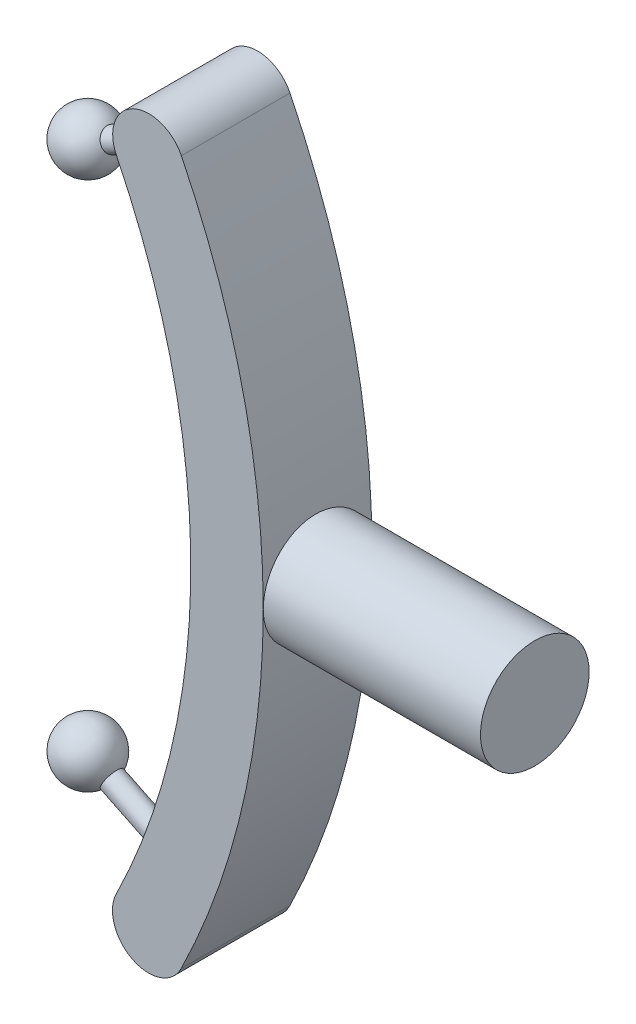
from build123d import *

# Parameters (mm, degrees)
BASE_EXTRUDE_DEPTH = 9.525
SKETCH4_W          = 44.44999999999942
SKETCH4_H          = 9.525000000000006


with BuildPart() as part:
    # Sketch2 → Base-Extrude (new, symmetric)
    with BuildSketch(Plane.XY):
        with BuildLine():
            ThreePointArc((113.9093758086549, -56.15740470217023), (126.99999383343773, -0.03957660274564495), (113.94435398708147, 56.086399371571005))
            ThreePointArc((113.94435398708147, 56.086399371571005), (116.83725171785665, 64.58793703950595), (125.33878938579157, 61.69503930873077))
            ThreePointArc((125.33878938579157, 61.69503930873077), (136.0672698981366, 31.651035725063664), (139.69999321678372, -0.04353426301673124))
            ThreePointArc((139.69999321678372, -0.04353426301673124), (136.04751685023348, -31.73583398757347), (125.30031338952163, -61.77314517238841))
            ThreePointArc((125.30031338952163, -61.77314517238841), (116.79697436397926, -64.66074372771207), (113.9093758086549, -56.15740470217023))
        make_face()
    extrude(amount=BASE_EXTRUDE_DEPTH, both=True)

    # Sketch4 → Boss-Revolve2 (revolve)
    with BuildSketch(Plane.XY, mode=Mode.PRIVATE) as boss_revolve2_sk:
        with Locations((155.5749999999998, 4.762500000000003)):
            Rectangle(SKETCH4_W, SKETCH4_H)
    revolve(boss_revolve2_sk.sketch.rotate(Axis((177.7999999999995, 0, 0), (-1, 0, 0)), 90), axis=Axis((177.7999999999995, 0, 0), (-1, 0, 0)))

    # Sketch3 → Boss-Revolve1 (revolve)
    with BuildSketch(Plane.XY):
        Polygon((99.40913490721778, 46.485892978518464), (120.64367379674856, 56.83447945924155), (119.8091103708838, 58.546942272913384), (98.57457148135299, 48.19835579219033), align=None)
    boss_revolve1 = revolve(axis=Axis((120.64367379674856, 56.83447945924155, 0), (-0.8989306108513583, -0.43809103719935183, 0)))

    # Sketch5 → Boss-Revolve3 (revolve)
    with BuildSketch(Plane.XY):
        with BuildLine():
            Line((94.84256740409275, 44.260390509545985), (103.71218255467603, 48.582969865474))
            Line((103.71218255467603, 48.582969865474), (103.97570241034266, 48.71139544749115))
            ThreePointArc((103.97570241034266, 48.71139544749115), (97.18363243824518, 51.05246048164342), (94.84256740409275, 44.260390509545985))
        make_face()
    boss_revolve3 = revolve(axis=Axis((99.40913490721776, 46.48589297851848, 0), (0.8989306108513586, 0.43809103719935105, 0)))

    # Mirror1: Boss-Revolve1, Boss-Revolve3 across plane
    add(boss_revolve1.mirror(Plane.ZX))
    add(boss_revolve3.mirror(Plane.ZX))


solid = part.part
